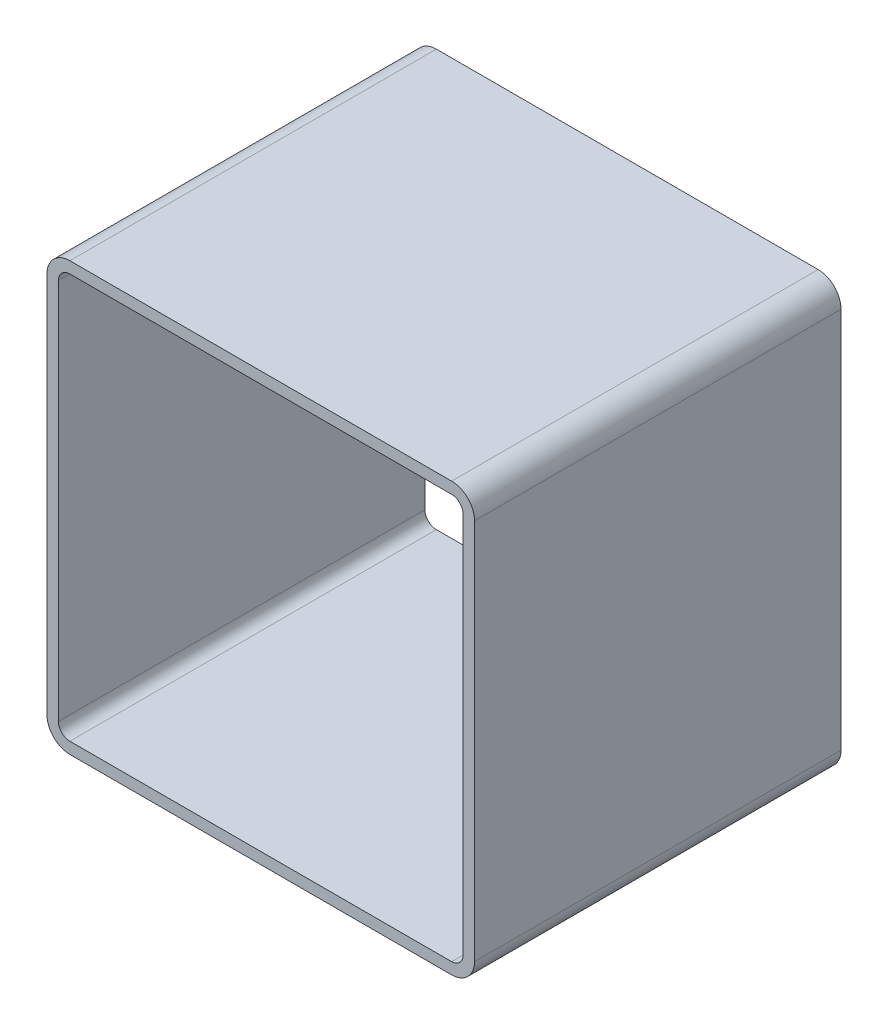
ISO-10303-21;
HEADER;
FILE_DESCRIPTION(('STEP AP214'),'2;1');
FILE_NAME('part.step','',(''),(''),'','','');
FILE_SCHEMA(('AUTOMOTIVE_DESIGN { 1 0 10303 214 1 1 1 1 }'));
ENDSEC;
DATA;
#1=APPLICATION_CONTEXT('core data for automotive mechanical design processes');
#2=APPLICATION_PROTOCOL_DEFINITION('international standard','automotive_design',2000,#1);
#3=PRODUCT_CONTEXT('',#1,'mechanical');
#4=PRODUCT('Part','Part','',(#3));
#5=PRODUCT_RELATED_PRODUCT_CATEGORY('part','',(#4));
#6=PRODUCT_DEFINITION_FORMATION('','',#4);
#7=PRODUCT_DEFINITION_CONTEXT('part definition',#1,'design');
#8=PRODUCT_DEFINITION('design','',#6,#7);
#9=PRODUCT_DEFINITION_SHAPE('','',#8);
#10=(LENGTH_UNIT() NAMED_UNIT(*) SI_UNIT(.MILLI.,.METRE.));
#11=(NAMED_UNIT(*) PLANE_ANGLE_UNIT() SI_UNIT($,.RADIAN.));
#12=(NAMED_UNIT(*) SI_UNIT($,.STERADIAN.) SOLID_ANGLE_UNIT());
#13=UNCERTAINTY_MEASURE_WITH_UNIT(LENGTH_MEASURE(1.E-05),#10,'distance_accuracy_value','');
#14=(GEOMETRIC_REPRESENTATION_CONTEXT(3) GLOBAL_UNCERTAINTY_ASSIGNED_CONTEXT((#13)) GLOBAL_UNIT_ASSIGNED_CONTEXT((#10,
#11,#12)) REPRESENTATION_CONTEXT('',''));
#15=CARTESIAN_POINT('',(0.,0.,0.));
#16=DIRECTION('',(0.,0.,1.));
#17=DIRECTION('',(1.,0.,0.));
#18=AXIS2_PLACEMENT_3D('',#15,#16,#17);
#19=CARTESIAN_POINT('',(21.5003420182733,338.378679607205,304.8));
#20=DIRECTION('',(0.,0.,1.));
#21=DIRECTION('',(1.,0.,0.));
#22=AXIS2_PLACEMENT_3D('',#19,#20,#21);
#23=PLANE('',#22);
#24=CARTESIAN_POINT('',(21.5003420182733,338.378679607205,304.8));
#25=DIRECTION('',(0.,0.,1.));
#26=DIRECTION('',(1.,0.,0.));
#27=AXIS2_PLACEMENT_3D('',#24,#25,#26);
#28=CIRCLE('',#27,19.05);
#29=CARTESIAN_POINT('',(21.5003420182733,357.428679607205,304.8));
#30=VERTEX_POINT('',#29);
#31=CARTESIAN_POINT('',(2.45034201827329,338.378679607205,304.8));
#32=VERTEX_POINT('',#31);
#33=EDGE_CURVE('E211',#30,#32,#28,.T.);
#34=ORIENTED_EDGE('',*,*,#33,.T.);
#35=DIRECTION('',(0.,-1.,0.));
#36=VECTOR('',#35,1.);
#37=CARTESIAN_POINT('',(2.45034201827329,20.8786796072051,304.8));
#38=LINE('',#37,#36);
#39=CARTESIAN_POINT('',(2.45034201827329,20.8786796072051,304.8));
#40=VERTEX_POINT('',#39);
#41=EDGE_CURVE('E214',#32,#40,#38,.T.);
#42=ORIENTED_EDGE('',*,*,#41,.T.);
#43=CARTESIAN_POINT('',(21.5003420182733,20.8786796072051,304.8));
#44=DIRECTION('',(0.,0.,1.));
#45=DIRECTION('',(1.,0.,0.));
#46=AXIS2_PLACEMENT_3D('',#43,#44,#45);
#47=CIRCLE('',#46,19.05);
#48=CARTESIAN_POINT('',(21.5003420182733,1.82867960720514,304.8));
#49=VERTEX_POINT('',#48);
#50=EDGE_CURVE('E217',#40,#49,#47,.T.);
#51=ORIENTED_EDGE('',*,*,#50,.T.);
#52=DIRECTION('',(1.,0.,0.));
#53=VECTOR('',#52,1.);
#54=CARTESIAN_POINT('',(339.000342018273,1.82867960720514,304.8));
#55=LINE('',#54,#53);
#56=CARTESIAN_POINT('',(339.000342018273,1.82867960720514,304.8));
#57=VERTEX_POINT('',#56);
#58=EDGE_CURVE('E219',#49,#57,#55,.T.);
#59=ORIENTED_EDGE('',*,*,#58,.T.);
#60=CARTESIAN_POINT('',(339.000342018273,20.8786796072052,304.8));
#61=DIRECTION('',(0.,0.,1.));
#62=DIRECTION('',(1.,0.,0.));
#63=AXIS2_PLACEMENT_3D('',#60,#61,#62);
#64=CIRCLE('',#63,19.05);
#65=CARTESIAN_POINT('',(358.050342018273,20.8786796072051,304.8));
#66=VERTEX_POINT('',#65);
#67=EDGE_CURVE('E221',#57,#66,#64,.T.);
#68=ORIENTED_EDGE('',*,*,#67,.T.);
#69=DIRECTION('',(0.,1.,0.));
#70=VECTOR('',#69,1.);
#71=CARTESIAN_POINT('',(358.050342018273,338.378679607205,304.8));
#72=LINE('',#71,#70);
#73=CARTESIAN_POINT('',(358.050342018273,338.378679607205,304.8));
#74=VERTEX_POINT('',#73);
#75=EDGE_CURVE('E223',#66,#74,#72,.T.);
#76=ORIENTED_EDGE('',*,*,#75,.T.);
#77=CARTESIAN_POINT('',(339.000342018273,338.378679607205,304.8));
#78=DIRECTION('',(0.,0.,1.));
#79=DIRECTION('',(1.,0.,0.));
#80=AXIS2_PLACEMENT_3D('',#77,#78,#79);
#81=CIRCLE('',#80,19.05);
#82=CARTESIAN_POINT('',(339.000342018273,357.428679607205,304.8));
#83=VERTEX_POINT('',#82);
#84=EDGE_CURVE('E225',#74,#83,#81,.T.);
#85=ORIENTED_EDGE('',*,*,#84,.T.);
#86=DIRECTION('',(-1.,0.,0.));
#87=VECTOR('',#86,1.);
#88=CARTESIAN_POINT('',(21.5003420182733,357.428679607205,304.8));
#89=LINE('',#88,#87);
#90=EDGE_CURVE('E227',#83,#30,#89,.T.);
#91=ORIENTED_EDGE('',*,*,#90,.T.);
#92=EDGE_LOOP('',(#34,#42,#51,#59,#68,#76,#85,#91));
#93=FACE_BOUND('',#92,.T.);
#94=DIRECTION('',(0.,-1.,0.));
#95=VECTOR('',#94,1.);
#96=CARTESIAN_POINT('',(11.9753420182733,20.8786796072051,304.8));
#97=LINE('',#96,#95);
#98=CARTESIAN_POINT('',(11.9753420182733,338.378679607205,304.8));
#99=VERTEX_POINT('',#98);
#100=CARTESIAN_POINT('',(11.9753420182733,20.8786796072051,304.8));
#101=VERTEX_POINT('',#100);
#102=EDGE_CURVE('E154',#99,#101,#97,.T.);
#103=ORIENTED_EDGE('',*,*,#102,.F.);
#104=CARTESIAN_POINT('',(21.5003420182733,338.378679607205,304.8));
#105=DIRECTION('',(0.,0.,1.));
#106=DIRECTION('',(1.,0.,0.));
#107=AXIS2_PLACEMENT_3D('',#104,#105,#106);
#108=CIRCLE('',#107,9.52499999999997);
#109=CARTESIAN_POINT('',(21.5003420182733,347.903679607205,304.8));
#110=VERTEX_POINT('',#109);
#111=EDGE_CURVE('E146',#110,#99,#108,.T.);
#112=ORIENTED_EDGE('',*,*,#111,.F.);
#113=DIRECTION('',(-1.,0.,0.));
#114=VECTOR('',#113,1.);
#115=CARTESIAN_POINT('',(21.5003420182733,347.903679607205,304.8));
#116=LINE('',#115,#114);
#117=CARTESIAN_POINT('',(339.000342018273,347.903679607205,304.8));
#118=VERTEX_POINT('',#117);
#119=EDGE_CURVE('E179',#118,#110,#116,.T.);
#120=ORIENTED_EDGE('',*,*,#119,.F.);
#121=CARTESIAN_POINT('',(339.000342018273,338.378679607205,304.8));
#122=DIRECTION('',(0.,0.,1.));
#123=DIRECTION('',(1.,0.,0.));
#124=AXIS2_PLACEMENT_3D('',#121,#122,#123);
#125=CIRCLE('',#124,9.52499999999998);
#126=CARTESIAN_POINT('',(348.525342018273,338.378679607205,304.8));
#127=VERTEX_POINT('',#126);
#128=EDGE_CURVE('E177',#127,#118,#125,.T.);
#129=ORIENTED_EDGE('',*,*,#128,.F.);
#130=DIRECTION('',(0.,1.,0.));
#131=VECTOR('',#130,1.);
#132=CARTESIAN_POINT('',(348.525342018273,338.378679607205,304.8));
#133=LINE('',#132,#131);
#134=CARTESIAN_POINT('',(348.525342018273,20.8786796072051,304.8));
#135=VERTEX_POINT('',#134);
#136=EDGE_CURVE('E175',#135,#127,#133,.T.);
#137=ORIENTED_EDGE('',*,*,#136,.F.);
#138=CARTESIAN_POINT('',(339.000342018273,20.8786796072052,304.8));
#139=DIRECTION('',(0.,0.,1.));
#140=DIRECTION('',(1.,0.,0.));
#141=AXIS2_PLACEMENT_3D('',#138,#139,#140);
#142=CIRCLE('',#141,9.52500000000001);
#143=CARTESIAN_POINT('',(339.000342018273,11.3536796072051,304.8));
#144=VERTEX_POINT('',#143);
#145=EDGE_CURVE('E173',#144,#135,#142,.T.);
#146=ORIENTED_EDGE('',*,*,#145,.F.);
#147=DIRECTION('',(1.,0.,0.));
#148=VECTOR('',#147,1.);
#149=CARTESIAN_POINT('',(339.000342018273,11.3536796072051,304.8));
#150=LINE('',#149,#148);
#151=CARTESIAN_POINT('',(21.5003420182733,11.3536796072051,304.8));
#152=VERTEX_POINT('',#151);
#153=EDGE_CURVE('E169',#152,#144,#150,.T.);
#154=ORIENTED_EDGE('',*,*,#153,.F.);
#155=CARTESIAN_POINT('',(21.5003420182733,20.8786796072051,304.8));
#156=DIRECTION('',(0.,0.,1.));
#157=DIRECTION('',(1.,0.,0.));
#158=AXIS2_PLACEMENT_3D('',#155,#156,#157);
#159=CIRCLE('',#158,9.525);
#160=EDGE_CURVE('E167',#101,#152,#159,.T.);
#161=ORIENTED_EDGE('',*,*,#160,.F.);
#162=EDGE_LOOP('',(#103,#112,#120,#129,#137,#146,#154,#161));
#163=FACE_BOUND('',#162,.T.);
#164=ADVANCED_FACE('F33',(#93,#163),#23,.T.);
#165=CARTESIAN_POINT('',(21.5003420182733,338.378679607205,0.));
#166=DIRECTION('',(0.,0.,1.));
#167=DIRECTION('',(1.,0.,0.));
#168=AXIS2_PLACEMENT_3D('',#165,#166,#167);
#169=PLANE('',#168);
#170=CARTESIAN_POINT('',(21.5003420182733,338.378679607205,0.));
#171=DIRECTION('',(0.,0.,1.));
#172=DIRECTION('',(1.,0.,0.));
#173=AXIS2_PLACEMENT_3D('',#170,#171,#172);
#174=CIRCLE('',#173,19.05);
#175=CARTESIAN_POINT('',(21.5003420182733,357.428679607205,0.));
#176=VERTEX_POINT('',#175);
#177=CARTESIAN_POINT('',(2.45034201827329,338.378679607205,0.));
#178=VERTEX_POINT('',#177);
#179=EDGE_CURVE('E162',#176,#178,#174,.T.);
#180=ORIENTED_EDGE('',*,*,#179,.F.);
#181=DIRECTION('',(-1.,0.,0.));
#182=VECTOR('',#181,1.);
#183=CARTESIAN_POINT('',(21.5003420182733,357.428679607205,0.));
#184=LINE('',#183,#182);
#185=CARTESIAN_POINT('',(339.000342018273,357.428679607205,0.));
#186=VERTEX_POINT('',#185);
#187=EDGE_CURVE('E215',#186,#176,#184,.T.);
#188=ORIENTED_EDGE('',*,*,#187,.F.);
#189=CARTESIAN_POINT('',(339.000342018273,338.378679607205,0.));
#190=DIRECTION('',(0.,0.,1.));
#191=DIRECTION('',(1.,0.,0.));
#192=AXIS2_PLACEMENT_3D('',#189,#190,#191);
#193=CIRCLE('',#192,19.05);
#194=CARTESIAN_POINT('',(358.050342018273,338.378679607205,0.));
#195=VERTEX_POINT('',#194);
#196=EDGE_CURVE('E242',#195,#186,#193,.T.);
#197=ORIENTED_EDGE('',*,*,#196,.F.);
#198=DIRECTION('',(0.,1.,0.));
#199=VECTOR('',#198,1.);
#200=CARTESIAN_POINT('',(358.050342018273,338.378679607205,0.));
#201=LINE('',#200,#199);
#202=CARTESIAN_POINT('',(358.050342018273,20.8786796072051,0.));
#203=VERTEX_POINT('',#202);
#204=EDGE_CURVE('E240',#203,#195,#201,.T.);
#205=ORIENTED_EDGE('',*,*,#204,.F.);
#206=CARTESIAN_POINT('',(339.000342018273,20.8786796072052,0.));
#207=DIRECTION('',(0.,0.,1.));
#208=DIRECTION('',(1.,0.,0.));
#209=AXIS2_PLACEMENT_3D('',#206,#207,#208);
#210=CIRCLE('',#209,19.05);
#211=CARTESIAN_POINT('',(339.000342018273,1.82867960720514,0.));
#212=VERTEX_POINT('',#211);
#213=EDGE_CURVE('E238',#212,#203,#210,.T.);
#214=ORIENTED_EDGE('',*,*,#213,.F.);
#215=DIRECTION('',(1.,0.,0.));
#216=VECTOR('',#215,1.);
#217=CARTESIAN_POINT('',(339.000342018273,1.82867960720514,0.));
#218=LINE('',#217,#216);
#219=CARTESIAN_POINT('',(21.5003420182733,1.82867960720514,0.));
#220=VERTEX_POINT('',#219);
#221=EDGE_CURVE('E236',#220,#212,#218,.T.);
#222=ORIENTED_EDGE('',*,*,#221,.F.);
#223=CARTESIAN_POINT('',(21.5003420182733,20.8786796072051,0.));
#224=DIRECTION('',(0.,0.,1.));
#225=DIRECTION('',(1.,0.,0.));
#226=AXIS2_PLACEMENT_3D('',#223,#224,#225);
#227=CIRCLE('',#226,19.05);
#228=CARTESIAN_POINT('',(2.45034201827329,20.8786796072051,0.));
#229=VERTEX_POINT('',#228);
#230=EDGE_CURVE('E234',#229,#220,#227,.T.);
#231=ORIENTED_EDGE('',*,*,#230,.F.);
#232=DIRECTION('',(0.,-1.,0.));
#233=VECTOR('',#232,1.);
#234=CARTESIAN_POINT('',(2.45034201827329,20.8786796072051,0.));
#235=LINE('',#234,#233);
#236=EDGE_CURVE('E232',#178,#229,#235,.T.);
#237=ORIENTED_EDGE('',*,*,#236,.F.);
#238=EDGE_LOOP('',(#180,#188,#197,#205,#214,#222,#231,#237));
#239=FACE_BOUND('',#238,.T.);
#240=CARTESIAN_POINT('',(21.5003420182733,338.378679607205,0.));
#241=DIRECTION('',(0.,0.,1.));
#242=DIRECTION('',(1.,0.,0.));
#243=AXIS2_PLACEMENT_3D('',#240,#241,#242);
#244=CIRCLE('',#243,9.52499999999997);
#245=CARTESIAN_POINT('',(21.5003420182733,347.903679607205,0.));
#246=VERTEX_POINT('',#245);
#247=CARTESIAN_POINT('',(11.9753420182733,338.378679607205,0.));
#248=VERTEX_POINT('',#247);
#249=EDGE_CURVE('E56',#246,#248,#244,.T.);
#250=ORIENTED_EDGE('',*,*,#249,.T.);
#251=DIRECTION('',(0.,-1.,0.));
#252=VECTOR('',#251,1.);
#253=CARTESIAN_POINT('',(11.9753420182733,20.8786796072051,0.));
#254=LINE('',#253,#252);
#255=CARTESIAN_POINT('',(11.9753420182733,20.8786796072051,0.));
#256=VERTEX_POINT('',#255);
#257=EDGE_CURVE('E161',#248,#256,#254,.T.);
#258=ORIENTED_EDGE('',*,*,#257,.T.);
#259=CARTESIAN_POINT('',(21.5003420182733,20.8786796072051,0.));
#260=DIRECTION('',(0.,0.,1.));
#261=DIRECTION('',(1.,0.,0.));
#262=AXIS2_PLACEMENT_3D('',#259,#260,#261);
#263=CIRCLE('',#262,9.525);
#264=CARTESIAN_POINT('',(21.5003420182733,11.3536796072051,0.));
#265=VERTEX_POINT('',#264);
#266=EDGE_CURVE('E183',#256,#265,#263,.T.);
#267=ORIENTED_EDGE('',*,*,#266,.T.);
#268=DIRECTION('',(1.,0.,0.));
#269=VECTOR('',#268,1.);
#270=CARTESIAN_POINT('',(339.000342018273,11.3536796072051,0.));
#271=LINE('',#270,#269);
#272=CARTESIAN_POINT('',(339.000342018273,11.3536796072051,0.));
#273=VERTEX_POINT('',#272);
#274=EDGE_CURVE('E186',#265,#273,#271,.T.);
#275=ORIENTED_EDGE('',*,*,#274,.T.);
#276=CARTESIAN_POINT('',(339.000342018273,20.8786796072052,0.));
#277=DIRECTION('',(0.,0.,1.));
#278=DIRECTION('',(1.,0.,0.));
#279=AXIS2_PLACEMENT_3D('',#276,#277,#278);
#280=CIRCLE('',#279,9.52500000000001);
#281=CARTESIAN_POINT('',(348.525342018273,20.8786796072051,0.));
#282=VERTEX_POINT('',#281);
#283=EDGE_CURVE('E189',#273,#282,#280,.T.);
#284=ORIENTED_EDGE('',*,*,#283,.T.);
#285=DIRECTION('',(0.,1.,0.));
#286=VECTOR('',#285,1.);
#287=CARTESIAN_POINT('',(348.525342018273,338.378679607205,0.));
#288=LINE('',#287,#286);
#289=CARTESIAN_POINT('',(348.525342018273,338.378679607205,0.));
#290=VERTEX_POINT('',#289);
#291=EDGE_CURVE('E192',#282,#290,#288,.T.);
#292=ORIENTED_EDGE('',*,*,#291,.T.);
#293=CARTESIAN_POINT('',(339.000342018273,338.378679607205,0.));
#294=DIRECTION('',(0.,0.,1.));
#295=DIRECTION('',(1.,0.,0.));
#296=AXIS2_PLACEMENT_3D('',#293,#294,#295);
#297=CIRCLE('',#296,9.52499999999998);
#298=CARTESIAN_POINT('',(339.000342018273,347.903679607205,0.));
#299=VERTEX_POINT('',#298);
#300=EDGE_CURVE('E195',#290,#299,#297,.T.);
#301=ORIENTED_EDGE('',*,*,#300,.T.);
#302=DIRECTION('',(-1.,0.,0.));
#303=VECTOR('',#302,1.);
#304=CARTESIAN_POINT('',(21.5003420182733,347.903679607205,0.));
#305=LINE('',#304,#303);
#306=EDGE_CURVE('E155',#299,#246,#305,.T.);
#307=ORIENTED_EDGE('',*,*,#306,.T.);
#308=EDGE_LOOP('',(#250,#258,#267,#275,#284,#292,#301,#307));
#309=FACE_BOUND('',#308,.T.);
#310=ADVANCED_FACE('F272',(#239,#309),#169,.F.);
#311=CARTESIAN_POINT('',(21.5003420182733,338.378679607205,304.8));
#312=DIRECTION('',(0.,0.,-1.));
#313=DIRECTION('',(-1.,0.,0.));
#314=AXIS2_PLACEMENT_3D('',#311,#312,#313);
#315=CYLINDRICAL_SURFACE('',#314,19.05);
#316=ORIENTED_EDGE('',*,*,#179,.T.);
#317=DIRECTION('',(0.,0.,-1.));
#318=VECTOR('',#317,1.);
#319=CARTESIAN_POINT('',(2.45034201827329,338.378679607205,304.8));
#320=LINE('',#319,#318);
#321=EDGE_CURVE('E11',#32,#178,#320,.T.);
#322=ORIENTED_EDGE('',*,*,#321,.F.);
#323=ORIENTED_EDGE('',*,*,#33,.F.);
#324=DIRECTION('',(0.,0.,-1.));
#325=VECTOR('',#324,1.);
#326=CARTESIAN_POINT('',(21.5003420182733,357.428679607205,304.8));
#327=LINE('',#326,#325);
#328=EDGE_CURVE('E229',#30,#176,#327,.T.);
#329=ORIENTED_EDGE('',*,*,#328,.T.);
#330=EDGE_LOOP('',(#316,#322,#323,#329));
#331=FACE_BOUND('',#330,.T.);
#332=ADVANCED_FACE('F35',(#331),#315,.T.);
#333=CARTESIAN_POINT('',(2.45034201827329,20.8786796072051,304.8));
#334=DIRECTION('',(1.,0.,0.));
#335=DIRECTION('',(0.,0.,-1.));
#336=AXIS2_PLACEMENT_3D('',#333,#334,#335);
#337=PLANE('',#336);
#338=ORIENTED_EDGE('',*,*,#236,.T.);
#339=DIRECTION('',(0.,0.,-1.));
#340=VECTOR('',#339,1.);
#341=CARTESIAN_POINT('',(2.45034201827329,20.8786796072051,304.8));
#342=LINE('',#341,#340);
#343=EDGE_CURVE('E41',#40,#229,#342,.T.);
#344=ORIENTED_EDGE('',*,*,#343,.F.);
#345=ORIENTED_EDGE('',*,*,#41,.F.);
#346=ORIENTED_EDGE('',*,*,#321,.T.);
#347=EDGE_LOOP('',(#338,#344,#345,#346));
#348=FACE_BOUND('',#347,.T.);
#349=ADVANCED_FACE('F289',(#348),#337,.F.);
#350=CARTESIAN_POINT('',(21.5003420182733,20.8786796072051,304.8));
#351=DIRECTION('',(0.,0.,-1.));
#352=DIRECTION('',(-1.,0.,0.));
#353=AXIS2_PLACEMENT_3D('',#350,#351,#352);
#354=CYLINDRICAL_SURFACE('',#353,19.05);
#355=ORIENTED_EDGE('',*,*,#230,.T.);
#356=DIRECTION('',(0.,0.,-1.));
#357=VECTOR('',#356,1.);
#358=CARTESIAN_POINT('',(21.5003420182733,1.82867960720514,304.8));
#359=LINE('',#358,#357);
#360=EDGE_CURVE('E259',#49,#220,#359,.T.);
#361=ORIENTED_EDGE('',*,*,#360,.F.);
#362=ORIENTED_EDGE('',*,*,#50,.F.);
#363=ORIENTED_EDGE('',*,*,#343,.T.);
#364=EDGE_LOOP('',(#355,#361,#362,#363));
#365=FACE_BOUND('',#364,.T.);
#366=ADVANCED_FACE('F266',(#365),#354,.T.);
#367=CARTESIAN_POINT('',(339.000342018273,1.82867960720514,304.8));
#368=DIRECTION('',(0.,1.,0.));
#369=DIRECTION('',(0.,0.,1.));
#370=AXIS2_PLACEMENT_3D('',#367,#368,#369);
#371=PLANE('',#370);
#372=ORIENTED_EDGE('',*,*,#221,.T.);
#373=DIRECTION('',(0.,0.,-1.));
#374=VECTOR('',#373,1.);
#375=CARTESIAN_POINT('',(339.000342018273,1.82867960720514,304.8));
#376=LINE('',#375,#374);
#377=EDGE_CURVE('E256',#57,#212,#376,.T.);
#378=ORIENTED_EDGE('',*,*,#377,.F.);
#379=ORIENTED_EDGE('',*,*,#58,.F.);
#380=ORIENTED_EDGE('',*,*,#360,.T.);
#381=EDGE_LOOP('',(#372,#378,#379,#380));
#382=FACE_BOUND('',#381,.T.);
#383=ADVANCED_FACE('F278',(#382),#371,.F.);
#384=CARTESIAN_POINT('',(339.000342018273,20.8786796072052,304.8));
#385=DIRECTION('',(0.,0.,-1.));
#386=DIRECTION('',(-1.,0.,0.));
#387=AXIS2_PLACEMENT_3D('',#384,#385,#386);
#388=CYLINDRICAL_SURFACE('',#387,19.05);
#389=ORIENTED_EDGE('',*,*,#213,.T.);
#390=DIRECTION('',(0.,0.,-1.));
#391=VECTOR('',#390,1.);
#392=CARTESIAN_POINT('',(358.050342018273,20.8786796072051,304.8));
#393=LINE('',#392,#391);
#394=EDGE_CURVE('E253',#66,#203,#393,.T.);
#395=ORIENTED_EDGE('',*,*,#394,.F.);
#396=ORIENTED_EDGE('',*,*,#67,.F.);
#397=ORIENTED_EDGE('',*,*,#377,.T.);
#398=EDGE_LOOP('',(#389,#395,#396,#397));
#399=FACE_BOUND('',#398,.T.);
#400=ADVANCED_FACE('F282',(#399),#388,.T.);
#401=CARTESIAN_POINT('',(358.050342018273,338.378679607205,304.8));
#402=DIRECTION('',(-1.,0.,0.));
#403=DIRECTION('',(0.,0.,1.));
#404=AXIS2_PLACEMENT_3D('',#401,#402,#403);
#405=PLANE('',#404);
#406=ORIENTED_EDGE('',*,*,#204,.T.);
#407=DIRECTION('',(0.,0.,-1.));
#408=VECTOR('',#407,1.);
#409=CARTESIAN_POINT('',(358.050342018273,338.378679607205,304.8));
#410=LINE('',#409,#408);
#411=EDGE_CURVE('E250',#74,#195,#410,.T.);
#412=ORIENTED_EDGE('',*,*,#411,.F.);
#413=ORIENTED_EDGE('',*,*,#75,.F.);
#414=ORIENTED_EDGE('',*,*,#394,.T.);
#415=EDGE_LOOP('',(#406,#412,#413,#414));
#416=FACE_BOUND('',#415,.T.);
#417=ADVANCED_FACE('F302',(#416),#405,.F.);
#418=CARTESIAN_POINT('',(339.000342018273,338.378679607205,304.8));
#419=DIRECTION('',(0.,0.,-1.));
#420=DIRECTION('',(-1.,0.,0.));
#421=AXIS2_PLACEMENT_3D('',#418,#419,#420);
#422=CYLINDRICAL_SURFACE('',#421,19.05);
#423=ORIENTED_EDGE('',*,*,#196,.T.);
#424=DIRECTION('',(0.,0.,-1.));
#425=VECTOR('',#424,1.);
#426=CARTESIAN_POINT('',(339.000342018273,357.428679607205,304.8));
#427=LINE('',#426,#425);
#428=EDGE_CURVE('E247',#83,#186,#427,.T.);
#429=ORIENTED_EDGE('',*,*,#428,.F.);
#430=ORIENTED_EDGE('',*,*,#84,.F.);
#431=ORIENTED_EDGE('',*,*,#411,.T.);
#432=EDGE_LOOP('',(#423,#429,#430,#431));
#433=FACE_BOUND('',#432,.T.);
#434=ADVANCED_FACE('F300',(#433),#422,.T.);
#435=CARTESIAN_POINT('',(21.5003420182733,357.428679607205,304.8));
#436=DIRECTION('',(0.,-1.,0.));
#437=DIRECTION('',(0.,0.,-1.));
#438=AXIS2_PLACEMENT_3D('',#435,#436,#437);
#439=PLANE('',#438);
#440=ORIENTED_EDGE('',*,*,#187,.T.);
#441=ORIENTED_EDGE('',*,*,#328,.F.);
#442=ORIENTED_EDGE('',*,*,#90,.F.);
#443=ORIENTED_EDGE('',*,*,#428,.T.);
#444=EDGE_LOOP('',(#440,#441,#442,#443));
#445=FACE_BOUND('',#444,.T.);
#446=ADVANCED_FACE('F295',(#445),#439,.F.);
#447=CARTESIAN_POINT('',(21.5003420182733,338.378679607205,304.8));
#448=DIRECTION('',(0.,0.,-1.));
#449=DIRECTION('',(-1.,0.,0.));
#450=AXIS2_PLACEMENT_3D('',#447,#448,#449);
#451=CYLINDRICAL_SURFACE('',#450,9.52499999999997);
#452=ORIENTED_EDGE('',*,*,#249,.F.);
#453=DIRECTION('',(0.,0.,-1.));
#454=VECTOR('',#453,1.);
#455=CARTESIAN_POINT('',(21.5003420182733,347.903679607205,304.8));
#456=LINE('',#455,#454);
#457=EDGE_CURVE('E150',#110,#246,#456,.T.);
#458=ORIENTED_EDGE('',*,*,#457,.F.);
#459=ORIENTED_EDGE('',*,*,#111,.T.);
#460=DIRECTION('',(0.,0.,-1.));
#461=VECTOR('',#460,1.);
#462=CARTESIAN_POINT('',(11.9753420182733,338.378679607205,304.8));
#463=LINE('',#462,#461);
#464=EDGE_CURVE('E149',#99,#248,#463,.T.);
#465=ORIENTED_EDGE('',*,*,#464,.T.);
#466=EDGE_LOOP('',(#452,#458,#459,#465));
#467=FACE_BOUND('',#466,.T.);
#468=ADVANCED_FACE('F148',(#467),#451,.F.);
#469=CARTESIAN_POINT('',(11.9753420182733,20.8786796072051,304.8));
#470=DIRECTION('',(1.,0.,0.));
#471=DIRECTION('',(0.,0.,-1.));
#472=AXIS2_PLACEMENT_3D('',#469,#470,#471);
#473=PLANE('',#472);
#474=ORIENTED_EDGE('',*,*,#257,.F.);
#475=ORIENTED_EDGE('',*,*,#464,.F.);
#476=ORIENTED_EDGE('',*,*,#102,.T.);
#477=DIRECTION('',(0.,0.,-1.));
#478=VECTOR('',#477,1.);
#479=CARTESIAN_POINT('',(11.9753420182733,20.8786796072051,304.8));
#480=LINE('',#479,#478);
#481=EDGE_CURVE('E163',#101,#256,#480,.T.);
#482=ORIENTED_EDGE('',*,*,#481,.T.);
#483=EDGE_LOOP('',(#474,#475,#476,#482));
#484=FACE_BOUND('',#483,.T.);
#485=ADVANCED_FACE('F158',(#484),#473,.T.);
#486=CARTESIAN_POINT('',(21.5003420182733,20.8786796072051,304.8));
#487=DIRECTION('',(0.,0.,-1.));
#488=DIRECTION('',(-1.,0.,0.));
#489=AXIS2_PLACEMENT_3D('',#486,#487,#488);
#490=CYLINDRICAL_SURFACE('',#489,9.525);
#491=ORIENTED_EDGE('',*,*,#266,.F.);
#492=ORIENTED_EDGE('',*,*,#481,.F.);
#493=ORIENTED_EDGE('',*,*,#160,.T.);
#494=DIRECTION('',(0.,0.,-1.));
#495=VECTOR('',#494,1.);
#496=CARTESIAN_POINT('',(21.5003420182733,11.3536796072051,304.8));
#497=LINE('',#496,#495);
#498=EDGE_CURVE('E208',#152,#265,#497,.T.);
#499=ORIENTED_EDGE('',*,*,#498,.T.);
#500=EDGE_LOOP('',(#491,#492,#493,#499));
#501=FACE_BOUND('',#500,.T.);
#502=ADVANCED_FACE('F327',(#501),#490,.F.);
#503=CARTESIAN_POINT('',(339.000342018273,11.3536796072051,304.8));
#504=DIRECTION('',(0.,1.,0.));
#505=DIRECTION('',(0.,0.,1.));
#506=AXIS2_PLACEMENT_3D('',#503,#504,#505);
#507=PLANE('',#506);
#508=ORIENTED_EDGE('',*,*,#274,.F.);
#509=ORIENTED_EDGE('',*,*,#498,.F.);
#510=ORIENTED_EDGE('',*,*,#153,.T.);
#511=DIRECTION('',(0.,0.,-1.));
#512=VECTOR('',#511,1.);
#513=CARTESIAN_POINT('',(339.000342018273,11.3536796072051,304.8));
#514=LINE('',#513,#512);
#515=EDGE_CURVE('E206',#144,#273,#514,.T.);
#516=ORIENTED_EDGE('',*,*,#515,.T.);
#517=EDGE_LOOP('',(#508,#509,#510,#516));
#518=FACE_BOUND('',#517,.T.);
#519=ADVANCED_FACE('F331',(#518),#507,.T.);
#520=CARTESIAN_POINT('',(339.000342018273,20.8786796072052,304.8));
#521=DIRECTION('',(0.,0.,-1.));
#522=DIRECTION('',(-1.,0.,0.));
#523=AXIS2_PLACEMENT_3D('',#520,#521,#522);
#524=CYLINDRICAL_SURFACE('',#523,9.52500000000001);
#525=ORIENTED_EDGE('',*,*,#283,.F.);
#526=ORIENTED_EDGE('',*,*,#515,.F.);
#527=ORIENTED_EDGE('',*,*,#145,.T.);
#528=DIRECTION('',(0.,0.,-1.));
#529=VECTOR('',#528,1.);
#530=CARTESIAN_POINT('',(348.525342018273,20.8786796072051,304.8));
#531=LINE('',#530,#529);
#532=EDGE_CURVE('E204',#135,#282,#531,.T.);
#533=ORIENTED_EDGE('',*,*,#532,.T.);
#534=EDGE_LOOP('',(#525,#526,#527,#533));
#535=FACE_BOUND('',#534,.T.);
#536=ADVANCED_FACE('F337',(#535),#524,.F.);
#537=CARTESIAN_POINT('',(348.525342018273,338.378679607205,304.8));
#538=DIRECTION('',(-1.,0.,0.));
#539=DIRECTION('',(0.,0.,1.));
#540=AXIS2_PLACEMENT_3D('',#537,#538,#539);
#541=PLANE('',#540);
#542=ORIENTED_EDGE('',*,*,#291,.F.);
#543=ORIENTED_EDGE('',*,*,#532,.F.);
#544=ORIENTED_EDGE('',*,*,#136,.T.);
#545=DIRECTION('',(0.,0.,-1.));
#546=VECTOR('',#545,1.);
#547=CARTESIAN_POINT('',(348.525342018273,338.378679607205,304.8));
#548=LINE('',#547,#546);
#549=EDGE_CURVE('E202',#127,#290,#548,.T.);
#550=ORIENTED_EDGE('',*,*,#549,.T.);
#551=EDGE_LOOP('',(#542,#543,#544,#550));
#552=FACE_BOUND('',#551,.T.);
#553=ADVANCED_FACE('F341',(#552),#541,.T.);
#554=CARTESIAN_POINT('',(339.000342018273,338.378679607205,304.8));
#555=DIRECTION('',(0.,0.,-1.));
#556=DIRECTION('',(-1.,0.,0.));
#557=AXIS2_PLACEMENT_3D('',#554,#555,#556);
#558=CYLINDRICAL_SURFACE('',#557,9.52499999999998);
#559=ORIENTED_EDGE('',*,*,#300,.F.);
#560=ORIENTED_EDGE('',*,*,#549,.F.);
#561=ORIENTED_EDGE('',*,*,#128,.T.);
#562=DIRECTION('',(0.,0.,-1.));
#563=VECTOR('',#562,1.);
#564=CARTESIAN_POINT('',(339.000342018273,347.903679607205,304.8));
#565=LINE('',#564,#563);
#566=EDGE_CURVE('E48',#118,#299,#565,.T.);
#567=ORIENTED_EDGE('',*,*,#566,.T.);
#568=EDGE_LOOP('',(#559,#560,#561,#567));
#569=FACE_BOUND('',#568,.T.);
#570=ADVANCED_FACE('F345',(#569),#558,.F.);
#571=CARTESIAN_POINT('',(21.5003420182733,347.903679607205,304.8));
#572=DIRECTION('',(0.,-1.,0.));
#573=DIRECTION('',(0.,0.,-1.));
#574=AXIS2_PLACEMENT_3D('',#571,#572,#573);
#575=PLANE('',#574);
#576=ORIENTED_EDGE('',*,*,#306,.F.);
#577=ORIENTED_EDGE('',*,*,#566,.F.);
#578=ORIENTED_EDGE('',*,*,#119,.T.);
#579=ORIENTED_EDGE('',*,*,#457,.T.);
#580=EDGE_LOOP('',(#576,#577,#578,#579));
#581=FACE_BOUND('',#580,.T.);
#582=ADVANCED_FACE('F349',(#581),#575,.T.);
#583=CLOSED_SHELL('',(#164,#310,#332,#349,#366,#383,#400,#417,#434,#446,#468,#485,#502,#519,
#536,#553,#570,#582));
#584=MANIFOLD_SOLID_BREP('B2',#583);
#585=ADVANCED_BREP_SHAPE_REPRESENTATION('',(#18,#584),#14);
#586=SHAPE_DEFINITION_REPRESENTATION(#9,#585);
ENDSEC;
END-ISO-10303-21;
